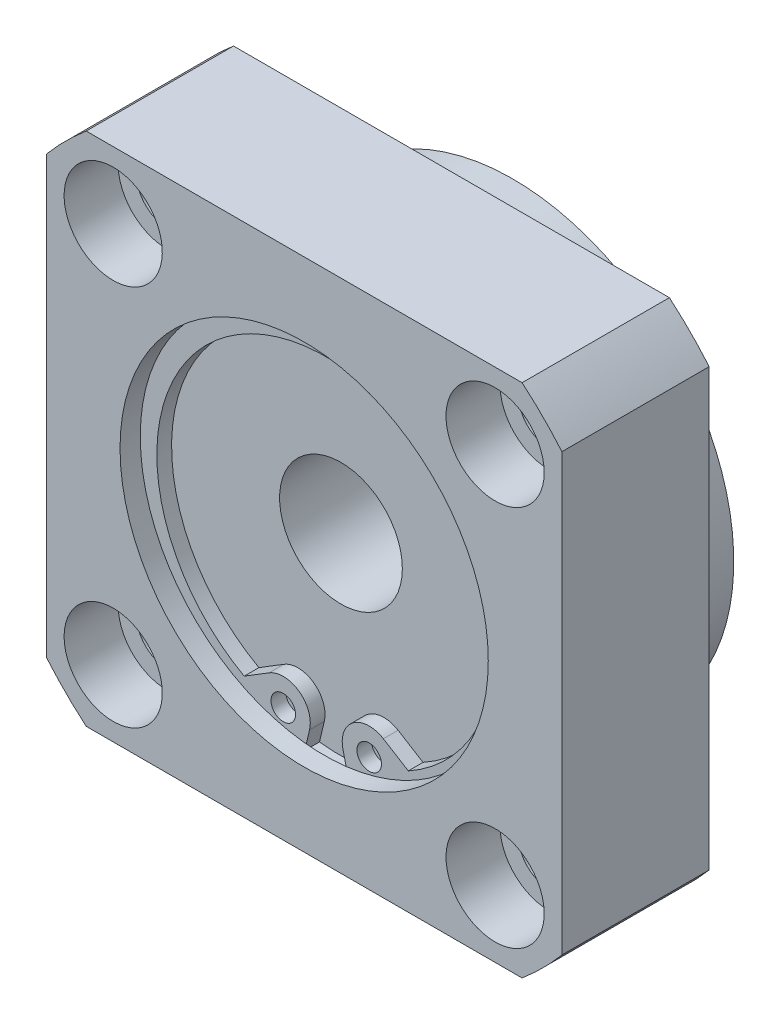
ISO-10303-21;
HEADER;
FILE_DESCRIPTION(('STEP AP214'),'2;1');
FILE_NAME('part.step','',(''),(''),'','','');
FILE_SCHEMA(('AUTOMOTIVE_DESIGN { 1 0 10303 214 1 1 1 1 }'));
ENDSEC;
DATA;
#1=APPLICATION_CONTEXT('core data for automotive mechanical design processes');
#2=APPLICATION_PROTOCOL_DEFINITION('international standard','automotive_design',2000,#1);
#3=PRODUCT_CONTEXT('',#1,'mechanical');
#4=PRODUCT('Part','Part','',(#3));
#5=PRODUCT_RELATED_PRODUCT_CATEGORY('part','',(#4));
#6=PRODUCT_DEFINITION_FORMATION('','',#4);
#7=PRODUCT_DEFINITION_CONTEXT('part definition',#1,'design');
#8=PRODUCT_DEFINITION('design','',#6,#7);
#9=PRODUCT_DEFINITION_SHAPE('','',#8);
#10=(LENGTH_UNIT() NAMED_UNIT(*) SI_UNIT(.MILLI.,.METRE.));
#11=(NAMED_UNIT(*) PLANE_ANGLE_UNIT() SI_UNIT($,.RADIAN.));
#12=(NAMED_UNIT(*) SI_UNIT($,.STERADIAN.) SOLID_ANGLE_UNIT());
#13=UNCERTAINTY_MEASURE_WITH_UNIT(LENGTH_MEASURE(1.E-05),#10,'distance_accuracy_value','');
#14=(GEOMETRIC_REPRESENTATION_CONTEXT(3) GLOBAL_UNCERTAINTY_ASSIGNED_CONTEXT((#13)) GLOBAL_UNIT_ASSIGNED_CONTEXT((#10,
#11,#12)) REPRESENTATION_CONTEXT('',''));
#15=CARTESIAN_POINT('',(0.,0.,0.));
#16=DIRECTION('',(0.,0.,1.));
#17=DIRECTION('',(1.,0.,0.));
#18=AXIS2_PLACEMENT_3D('',#15,#16,#17);
#19=CARTESIAN_POINT('',(0.,0.,9.));
#20=DIRECTION('',(0.,0.,1.));
#21=DIRECTION('',(1.,0.,0.));
#22=AXIS2_PLACEMENT_3D('',#19,#20,#21);
#23=PLANE('',#22);
#24=CARTESIAN_POINT('',(3.5,-13.4449694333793,9.));
#25=DIRECTION('',(0.,0.,1.));
#26=DIRECTION('',(1.,0.,0.));
#27=AXIS2_PLACEMENT_3D('',#24,#25,#26);
#28=CIRCLE('',#27,1.);
#29=CARTESIAN_POINT('',(4.5,-13.4449694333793,9.));
#30=VERTEX_POINT('',#29);
#31=EDGE_CURVE('E390',#30,#30,#28,.T.);
#32=ORIENTED_EDGE('',*,*,#31,.T.);
#33=EDGE_LOOP('',(#32));
#34=FACE_BOUND('',#33,.T.);
#35=ADVANCED_FACE('F14',(#34),#23,.T.);
#36=CARTESIAN_POINT('',(-3.5,-13.4449694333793,9.));
#37=DIRECTION('',(0.,0.,-1.));
#38=DIRECTION('',(1.,0.,0.));
#39=AXIS2_PLACEMENT_3D('',#36,#37,#38);
#40=CIRCLE('',#39,1.);
#41=CARTESIAN_POINT('',(-2.5,-13.4449694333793,9.));
#42=VERTEX_POINT('',#41);
#43=EDGE_CURVE('E395',#42,#42,#40,.T.);
#44=ORIENTED_EDGE('',*,*,#43,.F.);
#45=EDGE_LOOP('',(#44));
#46=FACE_BOUND('',#45,.T.);
#47=ADVANCED_FACE('F340',(#46),#23,.T.);
#48=CARTESIAN_POINT('',(15.556349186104,15.556349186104,0.));
#49=DIRECTION('',(0.,0.,1.));
#50=DIRECTION('',(1.,0.,0.));
#51=AXIS2_PLACEMENT_3D('',#48,#49,#50);
#52=CYLINDRICAL_SURFACE('',#51,2.5);
#53=CARTESIAN_POINT('',(15.556349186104,15.556349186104,0.));
#54=DIRECTION('',(0.,0.,1.));
#55=DIRECTION('',(1.,0.,0.));
#56=AXIS2_PLACEMENT_3D('',#53,#54,#55);
#57=CIRCLE('',#56,2.5);
#58=CARTESIAN_POINT('',(18.056349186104,15.556349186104,0.));
#59=VERTEX_POINT('',#58);
#60=EDGE_CURVE('E239',#59,#59,#57,.T.);
#61=ORIENTED_EDGE('',*,*,#60,.F.);
#62=EDGE_LOOP('',(#61));
#63=FACE_BOUND('',#62,.T.);
#64=CARTESIAN_POINT('',(15.556349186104,15.556349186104,7.6));
#65=DIRECTION('',(0.,0.,1.));
#66=DIRECTION('',(1.,0.,0.));
#67=AXIS2_PLACEMENT_3D('',#64,#65,#66);
#68=CIRCLE('',#67,2.5);
#69=CARTESIAN_POINT('',(18.056349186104,15.556349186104,7.6));
#70=VERTEX_POINT('',#69);
#71=EDGE_CURVE('E238',#70,#70,#68,.F.);
#72=ORIENTED_EDGE('',*,*,#71,.F.);
#73=EDGE_LOOP('',(#72));
#74=FACE_BOUND('',#73,.T.);
#75=ADVANCED_FACE('F348',(#63,#74),#52,.F.);
#76=CARTESIAN_POINT('',(15.556349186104,-15.5563491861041,0.));
#77=DIRECTION('',(0.,0.,1.));
#78=DIRECTION('',(1.,0.,0.));
#79=AXIS2_PLACEMENT_3D('',#76,#77,#78);
#80=CYLINDRICAL_SURFACE('',#79,2.5);
#81=CARTESIAN_POINT('',(15.556349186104,-15.5563491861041,0.));
#82=DIRECTION('',(0.,0.,1.));
#83=DIRECTION('',(0.,-1.,0.));
#84=AXIS2_PLACEMENT_3D('',#81,#82,#83);
#85=CIRCLE('',#84,2.5);
#86=CARTESIAN_POINT('',(15.556349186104,-18.0563491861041,0.));
#87=VERTEX_POINT('',#86);
#88=EDGE_CURVE('E229',#87,#87,#85,.T.);
#89=ORIENTED_EDGE('',*,*,#88,.F.);
#90=EDGE_LOOP('',(#89));
#91=FACE_BOUND('',#90,.T.);
#92=CARTESIAN_POINT('',(15.556349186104,-15.5563491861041,7.6));
#93=DIRECTION('',(0.,0.,1.));
#94=DIRECTION('',(1.,0.,0.));
#95=AXIS2_PLACEMENT_3D('',#92,#93,#94);
#96=CIRCLE('',#95,2.5);
#97=CARTESIAN_POINT('',(18.056349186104,-15.5563491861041,7.6));
#98=VERTEX_POINT('',#97);
#99=EDGE_CURVE('E222',#98,#98,#96,.F.);
#100=ORIENTED_EDGE('',*,*,#99,.F.);
#101=EDGE_LOOP('',(#100));
#102=FACE_BOUND('',#101,.T.);
#103=ADVANCED_FACE('F827',(#91,#102),#80,.F.);
#104=CARTESIAN_POINT('',(-15.5563491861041,-15.556349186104,0.));
#105=DIRECTION('',(0.,0.,1.));
#106=DIRECTION('',(1.,0.,0.));
#107=AXIS2_PLACEMENT_3D('',#104,#105,#106);
#108=CYLINDRICAL_SURFACE('',#107,2.5);
#109=CARTESIAN_POINT('',(-15.5563491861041,-15.556349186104,0.));
#110=DIRECTION('',(0.,0.,1.));
#111=DIRECTION('',(-1.,0.,0.));
#112=AXIS2_PLACEMENT_3D('',#109,#110,#111);
#113=CIRCLE('',#112,2.5);
#114=CARTESIAN_POINT('',(-18.0563491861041,-15.5563491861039,0.));
#115=VERTEX_POINT('',#114);
#116=EDGE_CURVE('E226',#115,#115,#113,.T.);
#117=ORIENTED_EDGE('',*,*,#116,.F.);
#118=EDGE_LOOP('',(#117));
#119=FACE_BOUND('',#118,.T.);
#120=CARTESIAN_POINT('',(-15.5563491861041,-15.556349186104,7.6));
#121=DIRECTION('',(0.,0.,1.));
#122=DIRECTION('',(1.,0.,0.));
#123=AXIS2_PLACEMENT_3D('',#120,#121,#122);
#124=CIRCLE('',#123,2.5);
#125=CARTESIAN_POINT('',(-13.0563491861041,-15.556349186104,7.6));
#126=VERTEX_POINT('',#125);
#127=EDGE_CURVE('E215',#126,#126,#124,.F.);
#128=ORIENTED_EDGE('',*,*,#127,.F.);
#129=EDGE_LOOP('',(#128));
#130=FACE_BOUND('',#129,.T.);
#131=ADVANCED_FACE('F817',(#119,#130),#108,.F.);
#132=CARTESIAN_POINT('',(-15.5563491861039,15.5563491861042,0.));
#133=DIRECTION('',(0.,0.,1.));
#134=DIRECTION('',(1.,0.,0.));
#135=AXIS2_PLACEMENT_3D('',#132,#133,#134);
#136=CYLINDRICAL_SURFACE('',#135,2.5);
#137=CARTESIAN_POINT('',(-15.5563491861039,15.5563491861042,0.));
#138=DIRECTION('',(0.,0.,1.));
#139=DIRECTION('',(0.,1.,0.));
#140=AXIS2_PLACEMENT_3D('',#137,#138,#139);
#141=CIRCLE('',#140,2.5);
#142=CARTESIAN_POINT('',(-15.5563491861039,18.0563491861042,0.));
#143=VERTEX_POINT('',#142);
#144=EDGE_CURVE('E223',#143,#143,#141,.T.);
#145=ORIENTED_EDGE('',*,*,#144,.F.);
#146=EDGE_LOOP('',(#145));
#147=FACE_BOUND('',#146,.T.);
#148=CARTESIAN_POINT('',(-15.5563491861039,15.5563491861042,7.6));
#149=DIRECTION('',(0.,0.,1.));
#150=DIRECTION('',(1.,0.,0.));
#151=AXIS2_PLACEMENT_3D('',#148,#149,#150);
#152=CIRCLE('',#151,2.5);
#153=CARTESIAN_POINT('',(-13.0563491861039,15.5563491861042,7.6));
#154=VERTEX_POINT('',#153);
#155=EDGE_CURVE('E208',#154,#154,#152,.F.);
#156=ORIENTED_EDGE('',*,*,#155,.F.);
#157=EDGE_LOOP('',(#156));
#158=FACE_BOUND('',#157,.T.);
#159=ADVANCED_FACE('F808',(#147,#158),#136,.F.);
#160=CARTESIAN_POINT('',(0.,0.,0.));
#161=DIRECTION('',(0.,0.,-1.));
#162=DIRECTION('',(-1.,0.,0.));
#163=AXIS2_PLACEMENT_3D('',#160,#161,#162);
#164=PLANE('',#163);
#165=CARTESIAN_POINT('',(0.,0.,0.));
#166=DIRECTION('',(0.,0.,-1.));
#167=DIRECTION('',(-1.,0.,0.));
#168=AXIS2_PLACEMENT_3D('',#165,#166,#167);
#169=CIRCLE('',#168,18.);
#170=CARTESIAN_POINT('',(-18.,0.,0.));
#171=VERTEX_POINT('',#170);
#172=EDGE_CURVE('E192',#171,#171,#169,.T.);
#173=ORIENTED_EDGE('',*,*,#172,.F.);
#174=EDGE_LOOP('',(#173));
#175=FACE_BOUND('',#174,.T.);
#176=ORIENTED_EDGE('',*,*,#144,.T.);
#177=EDGE_LOOP('',(#176));
#178=FACE_BOUND('',#177,.T.);
#179=ORIENTED_EDGE('',*,*,#116,.T.);
#180=EDGE_LOOP('',(#179));
#181=FACE_BOUND('',#180,.T.);
#182=ORIENTED_EDGE('',*,*,#88,.T.);
#183=EDGE_LOOP('',(#182));
#184=FACE_BOUND('',#183,.T.);
#185=ORIENTED_EDGE('',*,*,#60,.T.);
#186=EDGE_LOOP('',(#185));
#187=FACE_BOUND('',#186,.T.);
#188=CARTESIAN_POINT('',(0.,0.,0.));
#189=DIRECTION('',(0.,0.,-1.));
#190=DIRECTION('',(-1.,0.,0.));
#191=AXIS2_PLACEMENT_3D('',#188,#189,#190);
#192=CIRCLE('',#191,27.5);
#193=CARTESIAN_POINT('',(21.,-17.7552809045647,0.));
#194=VERTEX_POINT('',#193);
#195=CARTESIAN_POINT('',(17.7552809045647,-21.,0.));
#196=VERTEX_POINT('',#195);
#197=EDGE_CURVE('E245',#194,#196,#192,.T.);
#198=ORIENTED_EDGE('',*,*,#197,.T.);
#199=DIRECTION('',(1.,0.,0.));
#200=VECTOR('',#199,1.);
#201=CARTESIAN_POINT('',(-17.7552809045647,-21.,0.));
#202=LINE('',#201,#200);
#203=CARTESIAN_POINT('',(-17.7552809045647,-21.,0.));
#204=VERTEX_POINT('',#203);
#205=EDGE_CURVE('E248',#204,#196,#202,.T.);
#206=ORIENTED_EDGE('',*,*,#205,.F.);
#207=CARTESIAN_POINT('',(0.,0.,0.));
#208=DIRECTION('',(0.,0.,1.));
#209=DIRECTION('',(1.,0.,0.));
#210=AXIS2_PLACEMENT_3D('',#207,#208,#209);
#211=CIRCLE('',#210,27.5);
#212=CARTESIAN_POINT('',(-21.,-17.7552809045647,0.));
#213=VERTEX_POINT('',#212);
#214=EDGE_CURVE('E251',#213,#204,#211,.T.);
#215=ORIENTED_EDGE('',*,*,#214,.F.);
#216=DIRECTION('',(0.,-1.,0.));
#217=VECTOR('',#216,1.);
#218=CARTESIAN_POINT('',(-21.,17.7552809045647,0.));
#219=LINE('',#218,#217);
#220=CARTESIAN_POINT('',(-21.,17.7552809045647,0.));
#221=VERTEX_POINT('',#220);
#222=EDGE_CURVE('E254',#221,#213,#219,.T.);
#223=ORIENTED_EDGE('',*,*,#222,.F.);
#224=CARTESIAN_POINT('',(0.,0.,0.));
#225=DIRECTION('',(0.,0.,-1.));
#226=DIRECTION('',(-1.,0.,0.));
#227=AXIS2_PLACEMENT_3D('',#224,#225,#226);
#228=CIRCLE('',#227,27.5);
#229=CARTESIAN_POINT('',(-17.7552809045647,21.,0.));
#230=VERTEX_POINT('',#229);
#231=EDGE_CURVE('E257',#221,#230,#228,.T.);
#232=ORIENTED_EDGE('',*,*,#231,.T.);
#233=DIRECTION('',(1.,0.,0.));
#234=VECTOR('',#233,1.);
#235=CARTESIAN_POINT('',(-17.7552809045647,21.,0.));
#236=LINE('',#235,#234);
#237=CARTESIAN_POINT('',(17.7552809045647,21.,0.));
#238=VERTEX_POINT('',#237);
#239=EDGE_CURVE('E260',#230,#238,#236,.T.);
#240=ORIENTED_EDGE('',*,*,#239,.T.);
#241=CARTESIAN_POINT('',(0.,0.,0.));
#242=DIRECTION('',(0.,0.,1.));
#243=DIRECTION('',(1.,0.,0.));
#244=AXIS2_PLACEMENT_3D('',#241,#242,#243);
#245=CIRCLE('',#244,27.5);
#246=CARTESIAN_POINT('',(21.,17.7552809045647,0.));
#247=VERTEX_POINT('',#246);
#248=EDGE_CURVE('E263',#247,#238,#245,.T.);
#249=ORIENTED_EDGE('',*,*,#248,.F.);
#250=DIRECTION('',(0.,-1.,0.));
#251=VECTOR('',#250,1.);
#252=CARTESIAN_POINT('',(21.,17.7552809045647,0.));
#253=LINE('',#252,#251);
#254=EDGE_CURVE('E266',#247,#194,#253,.T.);
#255=ORIENTED_EDGE('',*,*,#254,.T.);
#256=EDGE_LOOP('',(#198,#206,#215,#223,#232,#240,#249,#255));
#257=FACE_BOUND('',#256,.T.);
#258=ADVANCED_FACE('F336',(#175,#178,#181,#184,#187,#257),#164,.T.);
#259=CARTESIAN_POINT('',(15.556349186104,15.556349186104,7.6));
#260=DIRECTION('',(0.,0.,1.));
#261=DIRECTION('',(1.,0.,0.));
#262=AXIS2_PLACEMENT_3D('',#259,#260,#261);
#263=PLANE('',#262);
#264=CARTESIAN_POINT('',(15.556349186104,15.556349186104,7.6));
#265=DIRECTION('',(0.,0.,1.));
#266=DIRECTION('',(1.,0.,0.));
#267=AXIS2_PLACEMENT_3D('',#264,#265,#266);
#268=CIRCLE('',#267,4.);
#269=CARTESIAN_POINT('',(19.5563491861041,15.556349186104,7.6));
#270=VERTEX_POINT('',#269);
#271=EDGE_CURVE('E235',#270,#270,#268,.T.);
#272=ORIENTED_EDGE('',*,*,#271,.T.);
#273=EDGE_LOOP('',(#272));
#274=FACE_BOUND('',#273,.T.);
#275=ORIENTED_EDGE('',*,*,#71,.T.);
#276=EDGE_LOOP('',(#275));
#277=FACE_BOUND('',#276,.T.);
#278=ADVANCED_FACE('F789',(#274,#277),#263,.T.);
#279=CARTESIAN_POINT('',(15.556349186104,-15.5563491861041,7.6));
#280=DIRECTION('',(0.,0.,1.));
#281=DIRECTION('',(0.,-1.,0.));
#282=AXIS2_PLACEMENT_3D('',#279,#280,#281);
#283=PLANE('',#282);
#284=CARTESIAN_POINT('',(15.556349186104,-15.5563491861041,7.6));
#285=DIRECTION('',(0.,0.,1.));
#286=DIRECTION('',(0.,-1.,0.));
#287=AXIS2_PLACEMENT_3D('',#284,#285,#286);
#288=CIRCLE('',#287,4.);
#289=CARTESIAN_POINT('',(15.556349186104,-19.5563491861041,7.6));
#290=VERTEX_POINT('',#289);
#291=EDGE_CURVE('E219',#290,#290,#288,.T.);
#292=ORIENTED_EDGE('',*,*,#291,.T.);
#293=EDGE_LOOP('',(#292));
#294=FACE_BOUND('',#293,.T.);
#295=ORIENTED_EDGE('',*,*,#99,.T.);
#296=EDGE_LOOP('',(#295));
#297=FACE_BOUND('',#296,.T.);
#298=ADVANCED_FACE('F779',(#294,#297),#283,.T.);
#299=CARTESIAN_POINT('',(-15.5563491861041,-15.556349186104,7.6));
#300=DIRECTION('',(0.,0.,1.));
#301=DIRECTION('',(-1.,0.,0.));
#302=AXIS2_PLACEMENT_3D('',#299,#300,#301);
#303=PLANE('',#302);
#304=CARTESIAN_POINT('',(-15.5563491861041,-15.556349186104,7.6));
#305=DIRECTION('',(0.,0.,1.));
#306=DIRECTION('',(-1.,0.,0.));
#307=AXIS2_PLACEMENT_3D('',#304,#305,#306);
#308=CIRCLE('',#307,4.);
#309=CARTESIAN_POINT('',(-19.5563491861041,-15.5563491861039,7.6));
#310=VERTEX_POINT('',#309);
#311=EDGE_CURVE('E212',#310,#310,#308,.T.);
#312=ORIENTED_EDGE('',*,*,#311,.T.);
#313=EDGE_LOOP('',(#312));
#314=FACE_BOUND('',#313,.T.);
#315=ORIENTED_EDGE('',*,*,#127,.T.);
#316=EDGE_LOOP('',(#315));
#317=FACE_BOUND('',#316,.T.);
#318=ADVANCED_FACE('F769',(#314,#317),#303,.T.);
#319=CARTESIAN_POINT('',(-15.5563491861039,15.5563491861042,7.6));
#320=DIRECTION('',(0.,0.,1.));
#321=DIRECTION('',(0.,1.,0.));
#322=AXIS2_PLACEMENT_3D('',#319,#320,#321);
#323=PLANE('',#322);
#324=CARTESIAN_POINT('',(-15.5563491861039,15.5563491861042,7.6));
#325=DIRECTION('',(0.,0.,1.));
#326=DIRECTION('',(0.,1.,0.));
#327=AXIS2_PLACEMENT_3D('',#324,#325,#326);
#328=CIRCLE('',#327,4.);
#329=CARTESIAN_POINT('',(-15.5563491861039,19.5563491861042,7.6));
#330=VERTEX_POINT('',#329);
#331=EDGE_CURVE('E205',#330,#330,#328,.T.);
#332=ORIENTED_EDGE('',*,*,#331,.T.);
#333=EDGE_LOOP('',(#332));
#334=FACE_BOUND('',#333,.T.);
#335=ORIENTED_EDGE('',*,*,#155,.T.);
#336=EDGE_LOOP('',(#335));
#337=FACE_BOUND('',#336,.T.);
#338=ADVANCED_FACE('F760',(#334,#337),#323,.T.);
#339=CARTESIAN_POINT('',(0.,0.,-5.));
#340=DIRECTION('',(0.,0.,1.));
#341=DIRECTION('',(1.,0.,0.));
#342=AXIS2_PLACEMENT_3D('',#339,#340,#341);
#343=CYLINDRICAL_SURFACE('',#342,18.);
#344=CARTESIAN_POINT('',(0.,0.,-5.));
#345=DIRECTION('',(0.,0.,-1.));
#346=DIRECTION('',(-1.,0.,0.));
#347=AXIS2_PLACEMENT_3D('',#344,#345,#346);
#348=CIRCLE('',#347,18.);
#349=CARTESIAN_POINT('',(-18.,0.,-5.));
#350=VERTEX_POINT('',#349);
#351=EDGE_CURVE('E191',#350,#350,#348,.T.);
#352=ORIENTED_EDGE('',*,*,#351,.F.);
#353=EDGE_LOOP('',(#352));
#354=FACE_BOUND('',#353,.T.);
#355=ORIENTED_EDGE('',*,*,#172,.T.);
#356=EDGE_LOOP('',(#355));
#357=FACE_BOUND('',#356,.T.);
#358=ADVANCED_FACE('F750',(#354,#357),#343,.T.);
#359=CARTESIAN_POINT('',(-17.7552809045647,-21.,12.));
#360=DIRECTION('',(0.,1.,0.));
#361=DIRECTION('',(0.,0.,1.));
#362=AXIS2_PLACEMENT_3D('',#359,#360,#361);
#363=PLANE('',#362);
#364=DIRECTION('',(1.,0.,0.));
#365=VECTOR('',#364,1.);
#366=CARTESIAN_POINT('',(-17.7552809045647,-21.,12.));
#367=LINE('',#366,#365);
#368=CARTESIAN_POINT('',(-17.7552809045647,-21.,12.));
#369=VERTEX_POINT('',#368);
#370=CARTESIAN_POINT('',(17.7552809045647,-21.,12.));
#371=VERTEX_POINT('',#370);
#372=EDGE_CURVE('E271',#369,#371,#367,.T.);
#373=ORIENTED_EDGE('',*,*,#372,.F.);
#374=DIRECTION('',(0.,0.,-1.));
#375=VECTOR('',#374,1.);
#376=CARTESIAN_POINT('',(-17.7552809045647,-21.,12.));
#377=LINE('',#376,#375);
#378=EDGE_CURVE('E293',#369,#204,#377,.T.);
#379=ORIENTED_EDGE('',*,*,#378,.T.);
#380=ORIENTED_EDGE('',*,*,#205,.T.);
#381=DIRECTION('',(0.,0.,-1.));
#382=VECTOR('',#381,1.);
#383=CARTESIAN_POINT('',(17.7552809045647,-21.,12.));
#384=LINE('',#383,#382);
#385=EDGE_CURVE('E291',#371,#196,#384,.T.);
#386=ORIENTED_EDGE('',*,*,#385,.F.);
#387=EDGE_LOOP('',(#373,#379,#380,#386));
#388=FACE_BOUND('',#387,.T.);
#389=ADVANCED_FACE('F740',(#388),#363,.F.);
#390=CARTESIAN_POINT('',(0.,0.,12.));
#391=DIRECTION('',(0.,0.,-1.));
#392=DIRECTION('',(-1.,0.,0.));
#393=AXIS2_PLACEMENT_3D('',#390,#391,#392);
#394=CYLINDRICAL_SURFACE('',#393,27.5);
#395=ORIENTED_EDGE('',*,*,#378,.F.);
#396=CARTESIAN_POINT('',(0.,0.,12.));
#397=DIRECTION('',(0.,0.,1.));
#398=DIRECTION('',(1.,0.,0.));
#399=AXIS2_PLACEMENT_3D('',#396,#397,#398);
#400=CIRCLE('',#399,27.5);
#401=CARTESIAN_POINT('',(-21.,-17.7552809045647,12.));
#402=VERTEX_POINT('',#401);
#403=EDGE_CURVE('E274',#402,#369,#400,.T.);
#404=ORIENTED_EDGE('',*,*,#403,.F.);
#405=DIRECTION('',(0.,0.,-1.));
#406=VECTOR('',#405,1.);
#407=CARTESIAN_POINT('',(-21.,-17.7552809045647,12.));
#408=LINE('',#407,#406);
#409=EDGE_CURVE('E295',#402,#213,#408,.T.);
#410=ORIENTED_EDGE('',*,*,#409,.T.);
#411=ORIENTED_EDGE('',*,*,#214,.T.);
#412=EDGE_LOOP('',(#395,#404,#410,#411));
#413=FACE_BOUND('',#412,.T.);
#414=ADVANCED_FACE('F730',(#413),#394,.T.);
#415=CARTESIAN_POINT('',(-21.,17.7552809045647,12.));
#416=DIRECTION('',(1.,0.,0.));
#417=DIRECTION('',(0.,0.,-1.));
#418=AXIS2_PLACEMENT_3D('',#415,#416,#417);
#419=PLANE('',#418);
#420=ORIENTED_EDGE('',*,*,#409,.F.);
#421=DIRECTION('',(0.,-1.,0.));
#422=VECTOR('',#421,1.);
#423=CARTESIAN_POINT('',(-21.,17.7552809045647,12.));
#424=LINE('',#423,#422);
#425=CARTESIAN_POINT('',(-21.,17.7552809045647,12.));
#426=VERTEX_POINT('',#425);
#427=EDGE_CURVE('E277',#426,#402,#424,.T.);
#428=ORIENTED_EDGE('',*,*,#427,.F.);
#429=DIRECTION('',(0.,0.,-1.));
#430=VECTOR('',#429,1.);
#431=CARTESIAN_POINT('',(-21.,17.7552809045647,12.));
#432=LINE('',#431,#430);
#433=EDGE_CURVE('E297',#426,#221,#432,.T.);
#434=ORIENTED_EDGE('',*,*,#433,.T.);
#435=ORIENTED_EDGE('',*,*,#222,.T.);
#436=EDGE_LOOP('',(#420,#428,#434,#435));
#437=FACE_BOUND('',#436,.T.);
#438=ADVANCED_FACE('F720',(#437),#419,.F.);
#439=CARTESIAN_POINT('',(0.,0.,12.));
#440=DIRECTION('',(0.,0.,-1.));
#441=DIRECTION('',(-1.,0.,0.));
#442=AXIS2_PLACEMENT_3D('',#439,#440,#441);
#443=CYLINDRICAL_SURFACE('',#442,27.5);
#444=ORIENTED_EDGE('',*,*,#433,.F.);
#445=CARTESIAN_POINT('',(0.,0.,12.));
#446=DIRECTION('',(0.,0.,-1.));
#447=DIRECTION('',(-1.,0.,0.));
#448=AXIS2_PLACEMENT_3D('',#445,#446,#447);
#449=CIRCLE('',#448,27.5);
#450=CARTESIAN_POINT('',(-17.7552809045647,21.,12.));
#451=VERTEX_POINT('',#450);
#452=EDGE_CURVE('E280',#426,#451,#449,.T.);
#453=ORIENTED_EDGE('',*,*,#452,.T.);
#454=DIRECTION('',(0.,0.,-1.));
#455=VECTOR('',#454,1.);
#456=CARTESIAN_POINT('',(-17.7552809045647,21.,12.));
#457=LINE('',#456,#455);
#458=EDGE_CURVE('E299',#451,#230,#457,.T.);
#459=ORIENTED_EDGE('',*,*,#458,.T.);
#460=ORIENTED_EDGE('',*,*,#231,.F.);
#461=EDGE_LOOP('',(#444,#453,#459,#460));
#462=FACE_BOUND('',#461,.T.);
#463=ADVANCED_FACE('F710',(#462),#443,.T.);
#464=CARTESIAN_POINT('',(-17.7552809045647,21.,12.));
#465=DIRECTION('',(0.,1.,0.));
#466=DIRECTION('',(0.,0.,1.));
#467=AXIS2_PLACEMENT_3D('',#464,#465,#466);
#468=PLANE('',#467);
#469=ORIENTED_EDGE('',*,*,#458,.F.);
#470=DIRECTION('',(1.,0.,0.));
#471=VECTOR('',#470,1.);
#472=CARTESIAN_POINT('',(-17.7552809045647,21.,12.));
#473=LINE('',#472,#471);
#474=CARTESIAN_POINT('',(17.7552809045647,21.,12.));
#475=VERTEX_POINT('',#474);
#476=EDGE_CURVE('E283',#451,#475,#473,.T.);
#477=ORIENTED_EDGE('',*,*,#476,.T.);
#478=DIRECTION('',(0.,0.,-1.));
#479=VECTOR('',#478,1.);
#480=CARTESIAN_POINT('',(17.7552809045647,21.,12.));
#481=LINE('',#480,#479);
#482=EDGE_CURVE('E301',#475,#238,#481,.T.);
#483=ORIENTED_EDGE('',*,*,#482,.T.);
#484=ORIENTED_EDGE('',*,*,#239,.F.);
#485=EDGE_LOOP('',(#469,#477,#483,#484));
#486=FACE_BOUND('',#485,.T.);
#487=ADVANCED_FACE('F701',(#486),#468,.T.);
#488=CARTESIAN_POINT('',(0.,0.,12.));
#489=DIRECTION('',(0.,0.,-1.));
#490=DIRECTION('',(-1.,0.,0.));
#491=AXIS2_PLACEMENT_3D('',#488,#489,#490);
#492=CYLINDRICAL_SURFACE('',#491,27.5);
#493=ORIENTED_EDGE('',*,*,#482,.F.);
#494=CARTESIAN_POINT('',(0.,0.,12.));
#495=DIRECTION('',(0.,0.,1.));
#496=DIRECTION('',(1.,0.,0.));
#497=AXIS2_PLACEMENT_3D('',#494,#495,#496);
#498=CIRCLE('',#497,27.5);
#499=CARTESIAN_POINT('',(21.,17.7552809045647,12.));
#500=VERTEX_POINT('',#499);
#501=EDGE_CURVE('E286',#500,#475,#498,.T.);
#502=ORIENTED_EDGE('',*,*,#501,.F.);
#503=DIRECTION('',(0.,0.,-1.));
#504=VECTOR('',#503,1.);
#505=CARTESIAN_POINT('',(21.,17.7552809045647,12.));
#506=LINE('',#505,#504);
#507=EDGE_CURVE('E82',#500,#247,#506,.T.);
#508=ORIENTED_EDGE('',*,*,#507,.T.);
#509=ORIENTED_EDGE('',*,*,#248,.T.);
#510=EDGE_LOOP('',(#493,#502,#508,#509));
#511=FACE_BOUND('',#510,.T.);
#512=ADVANCED_FACE('F693',(#511),#492,.T.);
#513=CARTESIAN_POINT('',(21.,17.7552809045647,12.));
#514=DIRECTION('',(1.,0.,0.));
#515=DIRECTION('',(0.,0.,-1.));
#516=AXIS2_PLACEMENT_3D('',#513,#514,#515);
#517=PLANE('',#516);
#518=ORIENTED_EDGE('',*,*,#507,.F.);
#519=DIRECTION('',(0.,-1.,0.));
#520=VECTOR('',#519,1.);
#521=CARTESIAN_POINT('',(21.,17.7552809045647,12.));
#522=LINE('',#521,#520);
#523=CARTESIAN_POINT('',(21.,-17.7552809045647,12.));
#524=VERTEX_POINT('',#523);
#525=EDGE_CURVE('E289',#500,#524,#522,.T.);
#526=ORIENTED_EDGE('',*,*,#525,.T.);
#527=DIRECTION('',(0.,0.,-1.));
#528=VECTOR('',#527,1.);
#529=CARTESIAN_POINT('',(21.,-17.7552809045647,12.));
#530=LINE('',#529,#528);
#531=EDGE_CURVE('E89',#524,#194,#530,.T.);
#532=ORIENTED_EDGE('',*,*,#531,.T.);
#533=ORIENTED_EDGE('',*,*,#254,.F.);
#534=EDGE_LOOP('',(#518,#526,#532,#533));
#535=FACE_BOUND('',#534,.T.);
#536=ADVANCED_FACE('F16',(#535),#517,.T.);
#537=CARTESIAN_POINT('',(0.,0.,12.));
#538=DIRECTION('',(0.,0.,-1.));
#539=DIRECTION('',(-1.,0.,0.));
#540=AXIS2_PLACEMENT_3D('',#537,#538,#539);
#541=CYLINDRICAL_SURFACE('',#540,27.5);
#542=ORIENTED_EDGE('',*,*,#531,.F.);
#543=CARTESIAN_POINT('',(0.,0.,12.));
#544=DIRECTION('',(0.,0.,-1.));
#545=DIRECTION('',(-1.,0.,0.));
#546=AXIS2_PLACEMENT_3D('',#543,#544,#545);
#547=CIRCLE('',#546,27.5);
#548=EDGE_CURVE('E269',#524,#371,#547,.T.);
#549=ORIENTED_EDGE('',*,*,#548,.T.);
#550=ORIENTED_EDGE('',*,*,#385,.T.);
#551=ORIENTED_EDGE('',*,*,#197,.F.);
#552=EDGE_LOOP('',(#542,#549,#550,#551));
#553=FACE_BOUND('',#552,.T.);
#554=ADVANCED_FACE('F675',(#553),#541,.T.);
#555=CARTESIAN_POINT('',(15.556349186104,15.556349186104,7.6));
#556=DIRECTION('',(0.,0.,1.));
#557=DIRECTION('',(1.,0.,0.));
#558=AXIS2_PLACEMENT_3D('',#555,#556,#557);
#559=CYLINDRICAL_SURFACE('',#558,4.);
#560=ORIENTED_EDGE('',*,*,#271,.F.);
#561=EDGE_LOOP('',(#560));
#562=FACE_BOUND('',#561,.T.);
#563=CARTESIAN_POINT('',(15.556349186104,15.556349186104,12.));
#564=DIRECTION('',(0.,0.,1.));
#565=DIRECTION('',(1.,0.,0.));
#566=AXIS2_PLACEMENT_3D('',#563,#564,#565);
#567=CIRCLE('',#566,4.);
#568=CARTESIAN_POINT('',(19.5563491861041,15.556349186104,12.));
#569=VERTEX_POINT('',#568);
#570=EDGE_CURVE('E232',#569,#569,#567,.T.);
#571=ORIENTED_EDGE('',*,*,#570,.T.);
#572=EDGE_LOOP('',(#571));
#573=FACE_BOUND('',#572,.T.);
#574=ADVANCED_FACE('F665',(#562,#573),#559,.F.);
#575=CARTESIAN_POINT('',(15.556349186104,-15.5563491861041,7.6));
#576=DIRECTION('',(0.,0.,1.));
#577=DIRECTION('',(1.,0.,0.));
#578=AXIS2_PLACEMENT_3D('',#575,#576,#577);
#579=CYLINDRICAL_SURFACE('',#578,4.);
#580=ORIENTED_EDGE('',*,*,#291,.F.);
#581=EDGE_LOOP('',(#580));
#582=FACE_BOUND('',#581,.T.);
#583=CARTESIAN_POINT('',(15.556349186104,-15.5563491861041,12.));
#584=DIRECTION('',(0.,0.,1.));
#585=DIRECTION('',(0.,-1.,0.));
#586=AXIS2_PLACEMENT_3D('',#583,#584,#585);
#587=CIRCLE('',#586,4.);
#588=CARTESIAN_POINT('',(15.556349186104,-19.5563491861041,12.));
#589=VERTEX_POINT('',#588);
#590=EDGE_CURVE('E216',#589,#589,#587,.T.);
#591=ORIENTED_EDGE('',*,*,#590,.T.);
#592=EDGE_LOOP('',(#591));
#593=FACE_BOUND('',#592,.T.);
#594=ADVANCED_FACE('F655',(#582,#593),#579,.F.);
#595=CARTESIAN_POINT('',(-15.5563491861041,-15.556349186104,7.6));
#596=DIRECTION('',(0.,0.,1.));
#597=DIRECTION('',(1.,0.,0.));
#598=AXIS2_PLACEMENT_3D('',#595,#596,#597);
#599=CYLINDRICAL_SURFACE('',#598,4.);
#600=ORIENTED_EDGE('',*,*,#311,.F.);
#601=EDGE_LOOP('',(#600));
#602=FACE_BOUND('',#601,.T.);
#603=CARTESIAN_POINT('',(-15.5563491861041,-15.556349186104,12.));
#604=DIRECTION('',(0.,0.,1.));
#605=DIRECTION('',(-1.,0.,0.));
#606=AXIS2_PLACEMENT_3D('',#603,#604,#605);
#607=CIRCLE('',#606,4.);
#608=CARTESIAN_POINT('',(-19.5563491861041,-15.5563491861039,12.));
#609=VERTEX_POINT('',#608);
#610=EDGE_CURVE('E209',#609,#609,#607,.T.);
#611=ORIENTED_EDGE('',*,*,#610,.T.);
#612=EDGE_LOOP('',(#611));
#613=FACE_BOUND('',#612,.T.);
#614=ADVANCED_FACE('F645',(#602,#613),#599,.F.);
#615=CARTESIAN_POINT('',(-15.5563491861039,15.5563491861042,7.6));
#616=DIRECTION('',(0.,0.,1.));
#617=DIRECTION('',(1.,0.,0.));
#618=AXIS2_PLACEMENT_3D('',#615,#616,#617);
#619=CYLINDRICAL_SURFACE('',#618,4.);
#620=ORIENTED_EDGE('',*,*,#331,.F.);
#621=EDGE_LOOP('',(#620));
#622=FACE_BOUND('',#621,.T.);
#623=CARTESIAN_POINT('',(-15.5563491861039,15.5563491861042,12.));
#624=DIRECTION('',(0.,0.,1.));
#625=DIRECTION('',(0.,1.,0.));
#626=AXIS2_PLACEMENT_3D('',#623,#624,#625);
#627=CIRCLE('',#626,4.);
#628=CARTESIAN_POINT('',(-15.5563491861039,19.5563491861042,12.));
#629=VERTEX_POINT('',#628);
#630=EDGE_CURVE('E202',#629,#629,#627,.T.);
#631=ORIENTED_EDGE('',*,*,#630,.T.);
#632=EDGE_LOOP('',(#631));
#633=FACE_BOUND('',#632,.T.);
#634=ADVANCED_FACE('F635',(#622,#633),#619,.F.);
#635=CARTESIAN_POINT('',(0.,0.,-5.));
#636=DIRECTION('',(0.,0.,-1.));
#637=DIRECTION('',(-1.,0.,0.));
#638=AXIS2_PLACEMENT_3D('',#635,#636,#637);
#639=PLANE('',#638);
#640=ORIENTED_EDGE('',*,*,#351,.T.);
#641=EDGE_LOOP('',(#640));
#642=FACE_BOUND('',#641,.T.);
#643=CARTESIAN_POINT('',(0.,0.,-5.));
#644=DIRECTION('',(0.,0.,-1.));
#645=DIRECTION('',(-1.,0.,0.));
#646=AXIS2_PLACEMENT_3D('',#643,#644,#645);
#647=CIRCLE('',#646,12.);
#648=CARTESIAN_POINT('',(-12.,0.,-5.));
#649=VERTEX_POINT('',#648);
#650=EDGE_CURVE('E188',#649,#649,#647,.T.);
#651=ORIENTED_EDGE('',*,*,#650,.F.);
#652=EDGE_LOOP('',(#651));
#653=FACE_BOUND('',#652,.T.);
#654=ADVANCED_FACE('F625',(#642,#653),#639,.T.);
#655=CARTESIAN_POINT('',(0.,0.,12.));
#656=DIRECTION('',(0.,0.,-1.));
#657=DIRECTION('',(-1.,0.,0.));
#658=AXIS2_PLACEMENT_3D('',#655,#656,#657);
#659=PLANE('',#658);
#660=CARTESIAN_POINT('',(0.,0.,12.));
#661=DIRECTION('',(0.,0.,1.));
#662=DIRECTION('',(1.,0.,0.));
#663=AXIS2_PLACEMENT_3D('',#660,#661,#662);
#664=CIRCLE('',#663,15.);
#665=CARTESIAN_POINT('',(15.,0.,12.));
#666=VERTEX_POINT('',#665);
#667=EDGE_CURVE('E198',#666,#666,#664,.T.);
#668=ORIENTED_EDGE('',*,*,#667,.F.);
#669=EDGE_LOOP('',(#668));
#670=FACE_BOUND('',#669,.T.);
#671=ORIENTED_EDGE('',*,*,#630,.F.);
#672=EDGE_LOOP('',(#671));
#673=FACE_BOUND('',#672,.T.);
#674=ORIENTED_EDGE('',*,*,#610,.F.);
#675=EDGE_LOOP('',(#674));
#676=FACE_BOUND('',#675,.T.);
#677=ORIENTED_EDGE('',*,*,#590,.F.);
#678=EDGE_LOOP('',(#677));
#679=FACE_BOUND('',#678,.T.);
#680=ORIENTED_EDGE('',*,*,#570,.F.);
#681=EDGE_LOOP('',(#680));
#682=FACE_BOUND('',#681,.T.);
#683=ORIENTED_EDGE('',*,*,#548,.F.);
#684=ORIENTED_EDGE('',*,*,#525,.F.);
#685=ORIENTED_EDGE('',*,*,#501,.T.);
#686=ORIENTED_EDGE('',*,*,#476,.F.);
#687=ORIENTED_EDGE('',*,*,#452,.F.);
#688=ORIENTED_EDGE('',*,*,#427,.T.);
#689=ORIENTED_EDGE('',*,*,#403,.T.);
#690=ORIENTED_EDGE('',*,*,#372,.T.);
#691=EDGE_LOOP('',(#683,#684,#685,#686,#687,#688,#689,#690));
#692=FACE_BOUND('',#691,.T.);
#693=ADVANCED_FACE('F615',(#670,#673,#676,#679,#682,#692),#659,.F.);
#694=CARTESIAN_POINT('',(0.,0.,-5.));
#695=DIRECTION('',(0.,0.,1.));
#696=DIRECTION('',(1.,0.,0.));
#697=AXIS2_PLACEMENT_3D('',#694,#695,#696);
#698=CYLINDRICAL_SURFACE('',#697,12.);
#699=ORIENTED_EDGE('',*,*,#650,.T.);
#700=EDGE_LOOP('',(#699));
#701=FACE_BOUND('',#700,.T.);
#702=CARTESIAN_POINT('',(0.,0.,0.));
#703=DIRECTION('',(0.,0.,-1.));
#704=DIRECTION('',(-1.,0.,0.));
#705=AXIS2_PLACEMENT_3D('',#702,#703,#704);
#706=CIRCLE('',#705,12.);
#707=CARTESIAN_POINT('',(-12.,0.,0.));
#708=VERTEX_POINT('',#707);
#709=EDGE_CURVE('E185',#708,#708,#706,.T.);
#710=ORIENTED_EDGE('',*,*,#709,.F.);
#711=EDGE_LOOP('',(#710));
#712=FACE_BOUND('',#711,.T.);
#713=ADVANCED_FACE('F607',(#701,#712),#698,.F.);
#714=CARTESIAN_POINT('',(0.,0.,9.));
#715=DIRECTION('',(0.,0.,1.));
#716=DIRECTION('',(1.,0.,0.));
#717=AXIS2_PLACEMENT_3D('',#714,#715,#716);
#718=CYLINDRICAL_SURFACE('',#717,15.);
#719=CARTESIAN_POINT('',(0.,0.,10.35));
#720=DIRECTION('',(0.,0.,1.));
#721=DIRECTION('',(1.,0.,0.));
#722=AXIS2_PLACEMENT_3D('',#719,#720,#721);
#723=CIRCLE('',#722,15.);
#724=CARTESIAN_POINT('',(15.,0.,10.35));
#725=VERTEX_POINT('',#724);
#726=EDGE_CURVE('E183',#725,#725,#723,.F.);
#727=ORIENTED_EDGE('',*,*,#726,.T.);
#728=EDGE_LOOP('',(#727));
#729=FACE_BOUND('',#728,.T.);
#730=ORIENTED_EDGE('',*,*,#667,.T.);
#731=EDGE_LOOP('',(#730));
#732=FACE_BOUND('',#731,.T.);
#733=ADVANCED_FACE('F318',(#729,#732),#718,.F.);
#734=CARTESIAN_POINT('',(0.,0.,0.));
#735=DIRECTION('',(0.,0.,1.));
#736=DIRECTION('',(1.,0.,0.));
#737=AXIS2_PLACEMENT_3D('',#734,#735,#736);
#738=CIRCLE('',#737,5.);
#739=CARTESIAN_POINT('',(5.,0.,0.));
#740=VERTEX_POINT('',#739);
#741=EDGE_CURVE('E242',#740,#740,#738,.T.);
#742=ORIENTED_EDGE('',*,*,#741,.T.);
#743=EDGE_LOOP('',(#742));
#744=FACE_BOUND('',#743,.T.);
#745=ORIENTED_EDGE('',*,*,#709,.T.);
#746=EDGE_LOOP('',(#745));
#747=FACE_BOUND('',#746,.T.);
#748=ADVANCED_FACE('F323',(#744,#747),#164,.T.);
#749=CARTESIAN_POINT('',(0.,0.,10.35));
#750=DIRECTION('',(0.,0.,1.));
#751=DIRECTION('',(1.,0.,0.));
#752=AXIS2_PLACEMENT_3D('',#749,#750,#751);
#753=PLANE('',#752);
#754=CARTESIAN_POINT('',(0.,0.,10.35));
#755=DIRECTION('',(0.,0.,1.));
#756=DIRECTION('',(1.,0.,0.));
#757=AXIS2_PLACEMENT_3D('',#754,#755,#756);
#758=CIRCLE('',#757,15.7);
#759=CARTESIAN_POINT('',(15.7,0.,10.35));
#760=VERTEX_POINT('',#759);
#761=EDGE_CURVE('E180',#760,#760,#758,.T.);
#762=ORIENTED_EDGE('',*,*,#761,.F.);
#763=EDGE_LOOP('',(#762));
#764=FACE_BOUND('',#763,.T.);
#765=ORIENTED_EDGE('',*,*,#726,.F.);
#766=EDGE_LOOP('',(#765));
#767=FACE_BOUND('',#766,.T.);
#768=ADVANCED_FACE('F321',(#764,#767),#753,.F.);
#769=CARTESIAN_POINT('',(0.,0.,10.35));
#770=DIRECTION('',(0.,0.,-1.));
#771=DIRECTION('',(-1.,0.,0.));
#772=AXIS2_PLACEMENT_3D('',#769,#770,#771);
#773=CYLINDRICAL_SURFACE('',#772,15.7);
#774=ORIENTED_EDGE('',*,*,#761,.T.);
#775=EDGE_LOOP('',(#774));
#776=FACE_BOUND('',#775,.T.);
#777=DIRECTION('',(0.,0.,-1.));
#778=VECTOR('',#777,1.);
#779=CARTESIAN_POINT('',(1.75159098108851,-15.6019847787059,10.35));
#780=LINE('',#779,#778);
#781=CARTESIAN_POINT('',(1.75159098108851,-15.6019847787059,9.));
#782=VERTEX_POINT('',#781);
#783=CARTESIAN_POINT('',(1.75159098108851,-15.6019847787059,10.2));
#784=VERTEX_POINT('',#783);
#785=EDGE_CURVE('E18',#782,#784,#780,.F.);
#786=ORIENTED_EDGE('',*,*,#785,.F.);
#787=CARTESIAN_POINT('',(0.,0.,9.));
#788=DIRECTION('',(0.,0.,1.));
#789=DIRECTION('',(1.,0.,0.));
#790=AXIS2_PLACEMENT_3D('',#787,#788,#789);
#791=CIRCLE('',#790,15.7);
#792=CARTESIAN_POINT('',(-1.7515909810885,-15.6019847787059,9.));
#793=VERTEX_POINT('',#792);
#794=EDGE_CURVE('E147',#793,#782,#791,.T.);
#795=ORIENTED_EDGE('',*,*,#794,.F.);
#796=DIRECTION('',(0.,0.,-1.));
#797=VECTOR('',#796,1.);
#798=CARTESIAN_POINT('',(-1.7515909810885,-15.6019847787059,10.35));
#799=LINE('',#798,#797);
#800=CARTESIAN_POINT('',(-1.7515909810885,-15.6019847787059,10.2));
#801=VERTEX_POINT('',#800);
#802=EDGE_CURVE('E144',#801,#793,#799,.T.);
#803=ORIENTED_EDGE('',*,*,#802,.F.);
#804=CARTESIAN_POINT('',(0.,0.,10.2));
#805=DIRECTION('',(0.,0.,-1.));
#806=DIRECTION('',(-1.,0.,0.));
#807=AXIS2_PLACEMENT_3D('',#804,#805,#806);
#808=CIRCLE('',#807,15.7);
#809=EDGE_CURVE('E9',#784,#801,#808,.F.);
#810=ORIENTED_EDGE('',*,*,#809,.F.);
#811=EDGE_LOOP('',(#786,#795,#803,#810));
#812=FACE_BOUND('',#811,.T.);
#813=ADVANCED_FACE('F145',(#776,#812),#773,.F.);
#814=CARTESIAN_POINT('',(0.,0.,12.));
#815=DIRECTION('',(0.,0.,-1.));
#816=DIRECTION('',(-1.,0.,0.));
#817=AXIS2_PLACEMENT_3D('',#814,#815,#816);
#818=CYLINDRICAL_SURFACE('',#817,5.);
#819=ORIENTED_EDGE('',*,*,#741,.F.);
#820=EDGE_LOOP('',(#819));
#821=FACE_BOUND('',#820,.T.);
#822=CARTESIAN_POINT('',(0.,0.,9.));
#823=DIRECTION('',(0.,0.,1.));
#824=DIRECTION('',(1.,0.,0.));
#825=AXIS2_PLACEMENT_3D('',#822,#823,#824);
#826=CIRCLE('',#825,5.);
#827=CARTESIAN_POINT('',(5.,0.,9.));
#828=VERTEX_POINT('',#827);
#829=EDGE_CURVE('E201',#828,#828,#826,.T.);
#830=ORIENTED_EDGE('',*,*,#829,.T.);
#831=EDGE_LOOP('',(#830));
#832=FACE_BOUND('',#831,.T.);
#833=ADVANCED_FACE('F331',(#821,#832),#818,.F.);
#834=ORIENTED_EDGE('',*,*,#829,.F.);
#835=EDGE_LOOP('',(#834));
#836=FACE_BOUND('',#835,.T.);
#837=DIRECTION('',(0.231349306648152,-0.972870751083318,0.));
#838=VECTOR('',#837,1.);
#839=CARTESIAN_POINT('',(1.35968434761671,-13.9539379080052,9.));
#840=LINE('',#839,#838);
#841=CARTESIAN_POINT('',(1.35968434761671,-13.9539379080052,9.));
#842=VERTEX_POINT('',#841);
#843=EDGE_CURVE('E178',#842,#782,#840,.T.);
#844=ORIENTED_EDGE('',*,*,#843,.F.);
#845=CARTESIAN_POINT('',(3.5,-13.4449694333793,9.));
#846=DIRECTION('',(0.,0.,1.));
#847=DIRECTION('',(1.,0.,0.));
#848=AXIS2_PLACEMENT_3D('',#845,#846,#847);
#849=CIRCLE('',#848,2.2);
#850=CARTESIAN_POINT('',(4.6535366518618,-11.5716426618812,9.));
#851=VERTEX_POINT('',#850);
#852=EDGE_CURVE('E177',#851,#842,#849,.T.);
#853=ORIENTED_EDGE('',*,*,#852,.F.);
#854=DIRECTION('',(-0.851512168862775,0.524334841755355,0.));
#855=VECTOR('',#854,1.);
#856=CARTESIAN_POINT('',(4.6535366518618,-11.5716426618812,9.));
#857=LINE('',#856,#855);
#858=CARTESIAN_POINT('',(6.68514847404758,-12.8226463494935,9.));
#859=VERTEX_POINT('',#858);
#860=EDGE_CURVE('E414',#859,#851,#857,.T.);
#861=ORIENTED_EDGE('',*,*,#860,.F.);
#862=CARTESIAN_POINT('',(0.,-0.75,9.));
#863=DIRECTION('',(0.,0.,-1.));
#864=DIRECTION('',(0.,-1.,0.));
#865=AXIS2_PLACEMENT_3D('',#862,#863,#864);
#866=CIRCLE('',#865,13.8);
#867=CARTESIAN_POINT('',(-6.68514847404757,-12.8226463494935,9.));
#868=VERTEX_POINT('',#867);
#869=EDGE_CURVE('E418',#868,#859,#866,.T.);
#870=ORIENTED_EDGE('',*,*,#869,.F.);
#871=DIRECTION('',(-0.851512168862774,-0.524334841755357,0.));
#872=VECTOR('',#871,1.);
#873=CARTESIAN_POINT('',(-4.65353665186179,-11.5716426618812,9.));
#874=LINE('',#873,#872);
#875=CARTESIAN_POINT('',(-4.65353665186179,-11.5716426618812,9.));
#876=VERTEX_POINT('',#875);
#877=EDGE_CURVE('E149',#876,#868,#874,.T.);
#878=ORIENTED_EDGE('',*,*,#877,.F.);
#879=CARTESIAN_POINT('',(-3.5,-13.4449694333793,9.));
#880=DIRECTION('',(0.,0.,1.));
#881=DIRECTION('',(-1.,0.,0.));
#882=AXIS2_PLACEMENT_3D('',#879,#880,#881);
#883=CIRCLE('',#882,2.2);
#884=CARTESIAN_POINT('',(-1.3596843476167,-13.9539379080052,9.));
#885=VERTEX_POINT('',#884);
#886=EDGE_CURVE('E407',#885,#876,#883,.T.);
#887=ORIENTED_EDGE('',*,*,#886,.F.);
#888=DIRECTION('',(0.231349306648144,0.97287075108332,0.));
#889=VECTOR('',#888,1.);
#890=CARTESIAN_POINT('',(-1.3596843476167,-13.9539379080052,9.));
#891=LINE('',#890,#889);
#892=EDGE_CURVE('E409',#793,#885,#891,.T.);
#893=ORIENTED_EDGE('',*,*,#892,.F.);
#894=ORIENTED_EDGE('',*,*,#794,.T.);
#895=EDGE_LOOP('',(#844,#853,#861,#870,#878,#887,#893,#894));
#896=FACE_BOUND('',#895,.T.);
#897=ADVANCED_FACE('F343',(#836,#896),#23,.T.);
#898=CARTESIAN_POINT('',(0.,-0.75,10.2));
#899=DIRECTION('',(0.,0.,1.));
#900=DIRECTION('',(-1.,0.,0.));
#901=AXIS2_PLACEMENT_3D('',#898,#899,#900);
#902=CYLINDRICAL_SURFACE('',#901,13.8);
#903=ORIENTED_EDGE('',*,*,#869,.T.);
#904=DIRECTION('',(0.,0.,-1.));
#905=VECTOR('',#904,1.);
#906=CARTESIAN_POINT('',(6.68514847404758,-12.8226463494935,10.2));
#907=LINE('',#906,#905);
#908=CARTESIAN_POINT('',(6.68514847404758,-12.8226463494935,10.2));
#909=VERTEX_POINT('',#908);
#910=EDGE_CURVE('E410',#909,#859,#907,.T.);
#911=ORIENTED_EDGE('',*,*,#910,.F.);
#912=CARTESIAN_POINT('',(0.,-0.75,10.2));
#913=DIRECTION('',(0.,0.,-1.));
#914=DIRECTION('',(0.,-1.,0.));
#915=AXIS2_PLACEMENT_3D('',#912,#913,#914);
#916=CIRCLE('',#915,13.8);
#917=CARTESIAN_POINT('',(-6.68514847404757,-12.8226463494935,10.2));
#918=VERTEX_POINT('',#917);
#919=EDGE_CURVE('E441',#918,#909,#916,.T.);
#920=ORIENTED_EDGE('',*,*,#919,.F.);
#921=DIRECTION('',(0.,0.,-1.));
#922=VECTOR('',#921,1.);
#923=CARTESIAN_POINT('',(-6.68514847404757,-12.8226463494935,10.2));
#924=LINE('',#923,#922);
#925=EDGE_CURVE('E446',#918,#868,#924,.T.);
#926=ORIENTED_EDGE('',*,*,#925,.T.);
#927=EDGE_LOOP('',(#903,#911,#920,#926));
#928=FACE_BOUND('',#927,.T.);
#929=ADVANCED_FACE('F344',(#928),#902,.F.);
#930=CARTESIAN_POINT('',(4.6535366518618,-11.5716426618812,10.2));
#931=DIRECTION('',(-0.524334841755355,-0.851512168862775,0.));
#932=DIRECTION('',(-0.851512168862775,0.524334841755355,0.));
#933=AXIS2_PLACEMENT_3D('',#930,#931,#932);
#934=PLANE('',#933);
#935=ORIENTED_EDGE('',*,*,#860,.T.);
#936=DIRECTION('',(0.,0.,-1.));
#937=VECTOR('',#936,1.);
#938=CARTESIAN_POINT('',(4.6535366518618,-11.5716426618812,10.2));
#939=LINE('',#938,#937);
#940=CARTESIAN_POINT('',(4.6535366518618,-11.5716426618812,10.2));
#941=VERTEX_POINT('',#940);
#942=EDGE_CURVE('E174',#941,#851,#939,.T.);
#943=ORIENTED_EDGE('',*,*,#942,.F.);
#944=DIRECTION('',(-0.851512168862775,0.524334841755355,0.));
#945=VECTOR('',#944,1.);
#946=CARTESIAN_POINT('',(4.6535366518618,-11.5716426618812,10.2));
#947=LINE('',#946,#945);
#948=EDGE_CURVE('E421',#909,#941,#947,.T.);
#949=ORIENTED_EDGE('',*,*,#948,.F.);
#950=ORIENTED_EDGE('',*,*,#910,.T.);
#951=EDGE_LOOP('',(#935,#943,#949,#950));
#952=FACE_BOUND('',#951,.T.);
#953=ADVANCED_FACE('F357',(#952),#934,.F.);
#954=CARTESIAN_POINT('',(3.5,-13.4449694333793,10.2));
#955=DIRECTION('',(0.,0.,1.));
#956=DIRECTION('',(-1.,0.,0.));
#957=AXIS2_PLACEMENT_3D('',#954,#955,#956);
#958=CYLINDRICAL_SURFACE('',#957,2.2);
#959=ORIENTED_EDGE('',*,*,#852,.T.);
#960=DIRECTION('',(0.,0.,-1.));
#961=VECTOR('',#960,1.);
#962=CARTESIAN_POINT('',(1.35968434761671,-13.9539379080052,10.2));
#963=LINE('',#962,#961);
#964=CARTESIAN_POINT('',(1.35968434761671,-13.9539379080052,10.2));
#965=VERTEX_POINT('',#964);
#966=EDGE_CURVE('E405',#965,#842,#963,.T.);
#967=ORIENTED_EDGE('',*,*,#966,.F.);
#968=CARTESIAN_POINT('',(3.5,-13.4449694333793,10.2));
#969=DIRECTION('',(0.,0.,1.));
#970=DIRECTION('',(1.,0.,0.));
#971=AXIS2_PLACEMENT_3D('',#968,#969,#970);
#972=CIRCLE('',#971,2.2);
#973=EDGE_CURVE('E166',#941,#965,#972,.T.);
#974=ORIENTED_EDGE('',*,*,#973,.F.);
#975=ORIENTED_EDGE('',*,*,#942,.T.);
#976=EDGE_LOOP('',(#959,#967,#974,#975));
#977=FACE_BOUND('',#976,.T.);
#978=ADVANCED_FACE('F363',(#977),#958,.T.);
#979=CARTESIAN_POINT('',(-1.3596843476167,-13.9539379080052,10.2));
#980=DIRECTION('',(-0.97287075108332,0.231349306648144,0.));
#981=DIRECTION('',(0.,0.,1.));
#982=AXIS2_PLACEMENT_3D('',#979,#980,#981);
#983=PLANE('',#982);
#984=DIRECTION('',(0.231349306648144,0.97287075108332,0.));
#985=VECTOR('',#984,1.);
#986=CARTESIAN_POINT('',(-1.3596843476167,-13.9539379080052,10.2));
#987=LINE('',#986,#985);
#988=CARTESIAN_POINT('',(-1.3596843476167,-13.9539379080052,10.2));
#989=VERTEX_POINT('',#988);
#990=EDGE_CURVE('E102',#801,#989,#987,.T.);
#991=ORIENTED_EDGE('',*,*,#990,.F.);
#992=ORIENTED_EDGE('',*,*,#802,.T.);
#993=ORIENTED_EDGE('',*,*,#892,.T.);
#994=DIRECTION('',(0.,0.,-1.));
#995=VECTOR('',#994,1.);
#996=CARTESIAN_POINT('',(-1.3596843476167,-13.9539379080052,10.2));
#997=LINE('',#996,#995);
#998=EDGE_CURVE('E158',#989,#885,#997,.T.);
#999=ORIENTED_EDGE('',*,*,#998,.F.);
#1000=EDGE_LOOP('',(#991,#992,#993,#999));
#1001=FACE_BOUND('',#1000,.T.);
#1002=ADVANCED_FACE('F156',(#1001),#983,.F.);
#1003=CARTESIAN_POINT('',(0.,-0.75,10.2));
#1004=DIRECTION('',(0.,0.,-1.));
#1005=DIRECTION('',(0.,-1.,0.));
#1006=AXIS2_PLACEMENT_3D('',#1003,#1004,#1005);
#1007=PLANE('',#1006);
#1008=CARTESIAN_POINT('',(-3.5,-13.4449694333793,10.2));
#1009=DIRECTION('',(0.,0.,-1.));
#1010=DIRECTION('',(1.,0.,0.));
#1011=AXIS2_PLACEMENT_3D('',#1008,#1009,#1010);
#1012=CIRCLE('',#1011,1.);
#1013=CARTESIAN_POINT('',(-2.5,-13.4449694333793,10.2));
#1014=VERTEX_POINT('',#1013);
#1015=EDGE_CURVE('E169',#1014,#1014,#1012,.T.);
#1016=ORIENTED_EDGE('',*,*,#1015,.T.);
#1017=EDGE_LOOP('',(#1016));
#1018=FACE_BOUND('',#1017,.T.);
#1019=CARTESIAN_POINT('',(3.5,-13.4449694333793,10.2));
#1020=DIRECTION('',(0.,0.,1.));
#1021=DIRECTION('',(1.,0.,0.));
#1022=AXIS2_PLACEMENT_3D('',#1019,#1020,#1021);
#1023=CIRCLE('',#1022,1.);
#1024=CARTESIAN_POINT('',(4.5,-13.4449694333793,10.2));
#1025=VERTEX_POINT('',#1024);
#1026=EDGE_CURVE('E195',#1025,#1025,#1023,.T.);
#1027=ORIENTED_EDGE('',*,*,#1026,.F.);
#1028=EDGE_LOOP('',(#1027));
#1029=FACE_BOUND('',#1028,.T.);
#1030=DIRECTION('',(0.231349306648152,-0.972870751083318,0.));
#1031=VECTOR('',#1030,1.);
#1032=CARTESIAN_POINT('',(1.35968434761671,-13.9539379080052,10.2));
#1033=LINE('',#1032,#1031);
#1034=EDGE_CURVE('E154',#965,#784,#1033,.T.);
#1035=ORIENTED_EDGE('',*,*,#1034,.T.);
#1036=ORIENTED_EDGE('',*,*,#809,.T.);
#1037=ORIENTED_EDGE('',*,*,#990,.T.);
#1038=CARTESIAN_POINT('',(-3.5,-13.4449694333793,10.2));
#1039=DIRECTION('',(0.,0.,1.));
#1040=DIRECTION('',(-1.,0.,0.));
#1041=AXIS2_PLACEMENT_3D('',#1038,#1039,#1040);
#1042=CIRCLE('',#1041,2.2);
#1043=CARTESIAN_POINT('',(-4.65353665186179,-11.5716426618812,10.2));
#1044=VERTEX_POINT('',#1043);
#1045=EDGE_CURVE('E160',#989,#1044,#1042,.T.);
#1046=ORIENTED_EDGE('',*,*,#1045,.T.);
#1047=DIRECTION('',(-0.851512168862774,-0.524334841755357,0.));
#1048=VECTOR('',#1047,1.);
#1049=CARTESIAN_POINT('',(-4.65353665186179,-11.5716426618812,10.2));
#1050=LINE('',#1049,#1048);
#1051=EDGE_CURVE('E415',#1044,#918,#1050,.T.);
#1052=ORIENTED_EDGE('',*,*,#1051,.T.);
#1053=ORIENTED_EDGE('',*,*,#919,.T.);
#1054=ORIENTED_EDGE('',*,*,#948,.T.);
#1055=ORIENTED_EDGE('',*,*,#973,.T.);
#1056=EDGE_LOOP('',(#1035,#1036,#1037,#1046,#1052,#1053,#1054,#1055));
#1057=FACE_BOUND('',#1056,.T.);
#1058=ADVANCED_FACE('F152',(#1018,#1029,#1057),#1007,.F.);
#1059=CARTESIAN_POINT('',(3.5,-13.4449694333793,10.2));
#1060=DIRECTION('',(0.,0.,1.));
#1061=DIRECTION('',(-1.,0.,0.));
#1062=AXIS2_PLACEMENT_3D('',#1059,#1060,#1061);
#1063=CYLINDRICAL_SURFACE('',#1062,1.);
#1064=ORIENTED_EDGE('',*,*,#31,.F.);
#1065=EDGE_LOOP('',(#1064));
#1066=FACE_BOUND('',#1065,.T.);
#1067=ORIENTED_EDGE('',*,*,#1026,.T.);
#1068=EDGE_LOOP('',(#1067));
#1069=FACE_BOUND('',#1068,.T.);
#1070=ADVANCED_FACE('F374',(#1066,#1069),#1063,.F.);
#1071=CARTESIAN_POINT('',(-3.5,-13.4449694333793,10.2));
#1072=DIRECTION('',(0.,0.,1.));
#1073=DIRECTION('',(-1.,0.,0.));
#1074=AXIS2_PLACEMENT_3D('',#1071,#1072,#1073);
#1075=CYLINDRICAL_SURFACE('',#1074,1.);
#1076=ORIENTED_EDGE('',*,*,#43,.T.);
#1077=EDGE_LOOP('',(#1076));
#1078=FACE_BOUND('',#1077,.T.);
#1079=ORIENTED_EDGE('',*,*,#1015,.F.);
#1080=EDGE_LOOP('',(#1079));
#1081=FACE_BOUND('',#1080,.T.);
#1082=ADVANCED_FACE('F381',(#1078,#1081),#1075,.F.);
#1083=CARTESIAN_POINT('',(-4.65353665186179,-11.5716426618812,10.2));
#1084=DIRECTION('',(0.524334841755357,-0.851512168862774,0.));
#1085=DIRECTION('',(0.,0.,-1.));
#1086=AXIS2_PLACEMENT_3D('',#1083,#1084,#1085);
#1087=PLANE('',#1086);
#1088=ORIENTED_EDGE('',*,*,#877,.T.);
#1089=ORIENTED_EDGE('',*,*,#925,.F.);
#1090=ORIENTED_EDGE('',*,*,#1051,.F.);
#1091=DIRECTION('',(0.,0.,-1.));
#1092=VECTOR('',#1091,1.);
#1093=CARTESIAN_POINT('',(-4.65353665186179,-11.5716426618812,10.2));
#1094=LINE('',#1093,#1092);
#1095=EDGE_CURVE('E173',#1044,#876,#1094,.T.);
#1096=ORIENTED_EDGE('',*,*,#1095,.T.);
#1097=EDGE_LOOP('',(#1088,#1089,#1090,#1096));
#1098=FACE_BOUND('',#1097,.T.);
#1099=ADVANCED_FACE('F378',(#1098),#1087,.F.);
#1100=CARTESIAN_POINT('',(-3.5,-13.4449694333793,10.2));
#1101=DIRECTION('',(0.,0.,1.));
#1102=DIRECTION('',(-1.,0.,0.));
#1103=AXIS2_PLACEMENT_3D('',#1100,#1101,#1102);
#1104=CYLINDRICAL_SURFACE('',#1103,2.2);
#1105=ORIENTED_EDGE('',*,*,#886,.T.);
#1106=ORIENTED_EDGE('',*,*,#1095,.F.);
#1107=ORIENTED_EDGE('',*,*,#1045,.F.);
#1108=ORIENTED_EDGE('',*,*,#998,.T.);
#1109=EDGE_LOOP('',(#1105,#1106,#1107,#1108));
#1110=FACE_BOUND('',#1109,.T.);
#1111=ADVANCED_FACE('F371',(#1110),#1104,.T.);
#1112=CARTESIAN_POINT('',(1.35968434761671,-13.9539379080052,10.2));
#1113=DIRECTION('',(0.972870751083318,0.231349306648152,0.));
#1114=DIRECTION('',(0.,0.,-1.));
#1115=AXIS2_PLACEMENT_3D('',#1112,#1113,#1114);
#1116=PLANE('',#1115);
#1117=ORIENTED_EDGE('',*,*,#843,.T.);
#1118=ORIENTED_EDGE('',*,*,#785,.T.);
#1119=ORIENTED_EDGE('',*,*,#1034,.F.);
#1120=ORIENTED_EDGE('',*,*,#966,.T.);
#1121=EDGE_LOOP('',(#1117,#1118,#1119,#1120));
#1122=FACE_BOUND('',#1121,.T.);
#1123=ADVANCED_FACE('F350',(#1122),#1116,.F.);
#1124=CLOSED_SHELL('',(#35,#47,#75,#103,#131,#159,#258,#278,#298,#318,#338,#358,#389,#414,#438,
#463,#487,#512,#536,#554,#574,#594,#614,#634,#654,#693,#713,#733,#748,#768,#813,#833,#897,#929,
#953,#978,#1002,#1058,#1070,#1082,#1099,#1111,#1123));
#1125=MANIFOLD_SOLID_BREP('B1',#1124);
#1126=ADVANCED_BREP_SHAPE_REPRESENTATION('',(#18,#1125),#14);
#1127=SHAPE_DEFINITION_REPRESENTATION(#9,#1126);
ENDSEC;
END-ISO-10303-21;
